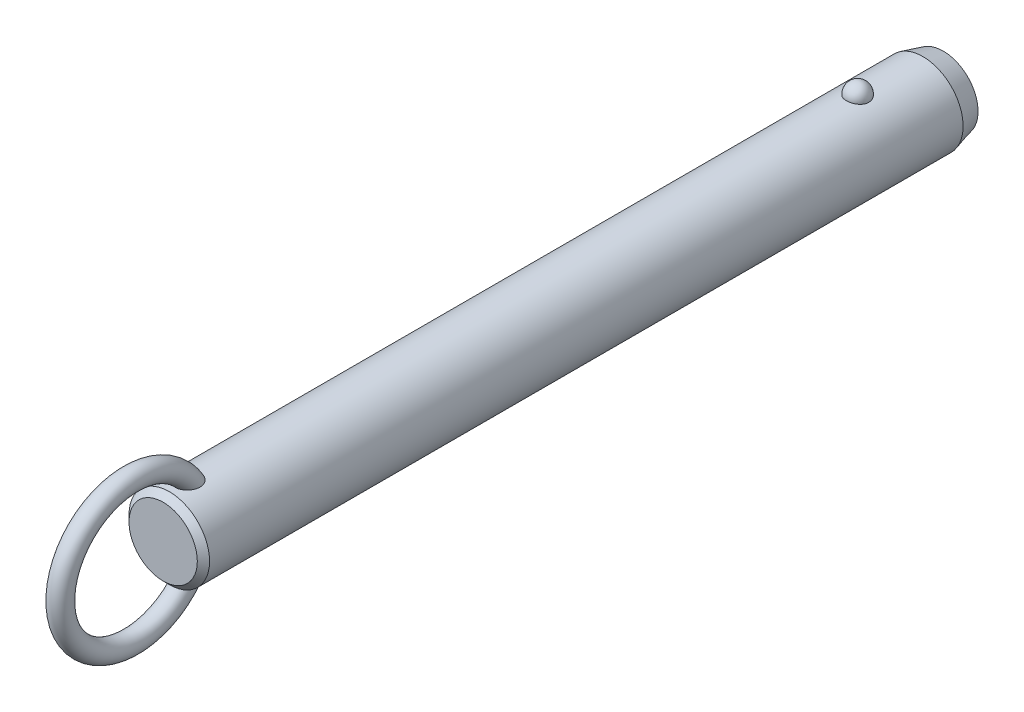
ISO-10303-21;
HEADER;
FILE_DESCRIPTION(('STEP AP214'),'2;1');
FILE_NAME('part.step','',(''),(''),'','','');
FILE_SCHEMA(('AUTOMOTIVE_DESIGN { 1 0 10303 214 1 1 1 1 }'));
ENDSEC;
DATA;
#1=APPLICATION_CONTEXT('core data for automotive mechanical design processes');
#2=APPLICATION_PROTOCOL_DEFINITION('international standard','automotive_design',2000,#1);
#3=PRODUCT_CONTEXT('',#1,'mechanical');
#4=PRODUCT('Part','Part','',(#3));
#5=PRODUCT_RELATED_PRODUCT_CATEGORY('part','',(#4));
#6=PRODUCT_DEFINITION_FORMATION('','',#4);
#7=PRODUCT_DEFINITION_CONTEXT('part definition',#1,'design');
#8=PRODUCT_DEFINITION('design','',#6,#7);
#9=PRODUCT_DEFINITION_SHAPE('','',#8);
#10=(LENGTH_UNIT() NAMED_UNIT(*) SI_UNIT(.MILLI.,.METRE.));
#11=(NAMED_UNIT(*) PLANE_ANGLE_UNIT() SI_UNIT($,.RADIAN.));
#12=(NAMED_UNIT(*) SI_UNIT($,.STERADIAN.) SOLID_ANGLE_UNIT());
#13=UNCERTAINTY_MEASURE_WITH_UNIT(LENGTH_MEASURE(1.E-05),#10,'distance_accuracy_value','');
#14=(GEOMETRIC_REPRESENTATION_CONTEXT(3) GLOBAL_UNCERTAINTY_ASSIGNED_CONTEXT((#13)) GLOBAL_UNIT_ASSIGNED_CONTEXT((#10,
#11,#12)) REPRESENTATION_CONTEXT('',''));
#15=CARTESIAN_POINT('',(0.,0.,0.));
#16=DIRECTION('',(0.,0.,1.));
#17=DIRECTION('',(1.,0.,0.));
#18=AXIS2_PLACEMENT_3D('',#15,#16,#17);
#19=CARTESIAN_POINT('',(0.,0.,124.5));
#20=DIRECTION('',(0.,0.,-1.));
#21=DIRECTION('',(-1.,0.,0.));
#22=AXIS2_PLACEMENT_3D('',#19,#20,#21);
#23=CYLINDRICAL_SURFACE('',#22,7.9);
#24=CARTESIAN_POINT('',(2.1785689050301,7.59367088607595,-2.19999999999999));
#25=CARTESIAN_POINT('',(2.17856679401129,7.59367269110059,-2.07701843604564));
#26=CARTESIAN_POINT('',(2.16853481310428,7.59657145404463,-1.95401006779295));
#27=CARTESIAN_POINT('',(2.12864689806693,7.607843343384,-1.71147811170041));
#28=CARTESIAN_POINT('',(2.09878338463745,7.61621856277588,-1.59195587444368));
#29=CARTESIAN_POINT('',(2.0199931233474,7.63749180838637,-1.3598563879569));
#30=CARTESIAN_POINT('',(1.97107475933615,7.6503878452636,-1.24727610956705));
#31=CARTESIAN_POINT('',(1.85539377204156,7.67926115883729,-1.03213234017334));
#32=CARTESIAN_POINT('',(1.78863158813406,7.69523835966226,-0.929568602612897));
#33=CARTESIAN_POINT('',(1.63856494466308,7.7285848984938,-0.736786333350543));
#34=CARTESIAN_POINT('',(1.55518140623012,7.7459606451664,-0.646630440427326));
#35=CARTESIAN_POINT('',(1.37422937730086,7.78009978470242,-0.481747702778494));
#36=CARTESIAN_POINT('',(1.27666086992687,7.79686317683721,-0.407020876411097));
#37=CARTESIAN_POINT('',(1.07024728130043,7.82786153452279,-0.275278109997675));
#38=CARTESIAN_POINT('',(0.961434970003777,7.84210353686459,-0.218212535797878));
#39=CARTESIAN_POINT('',(0.735351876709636,7.86652194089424,-0.123146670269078));
#40=CARTESIAN_POINT('',(0.618082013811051,7.87669878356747,-0.085144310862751));
#41=CARTESIAN_POINT('',(0.380637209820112,7.89170521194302,-0.0298158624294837));
#42=CARTESIAN_POINT('',(0.260550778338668,7.89662650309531,-0.0121347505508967));
#43=CARTESIAN_POINT('',(0.0190117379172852,7.90090003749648,0.00324379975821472));
#44=CARTESIAN_POINT('',(-0.102440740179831,7.90025280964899,0.00094313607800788));
#45=CARTESIAN_POINT('',(-0.341452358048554,7.89351056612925,-0.0233955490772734));
#46=CARTESIAN_POINT('',(-0.459042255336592,7.88749257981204,-0.0451545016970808));
#47=CARTESIAN_POINT('',(-0.688796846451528,7.87075812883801,-0.107408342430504));
#48=CARTESIAN_POINT('',(-0.800961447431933,7.86004158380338,-0.147903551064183));
#49=CARTESIAN_POINT('',(-1.01743634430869,7.83497131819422,-0.246799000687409));
#50=CARTESIAN_POINT('',(-1.12169791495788,7.82059709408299,-0.305300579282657));
#51=CARTESIAN_POINT('',(-1.31891765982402,7.78976470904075,-0.438549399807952));
#52=CARTESIAN_POINT('',(-1.41187469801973,7.77330633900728,-0.513298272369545));
#53=CARTESIAN_POINT('',(-1.58577142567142,7.73972434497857,-0.678622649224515));
#54=CARTESIAN_POINT('',(-1.66645140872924,7.72259402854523,-0.769470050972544));
#55=CARTESIAN_POINT('',(-1.81161503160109,7.68983776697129,-0.963538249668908));
#56=CARTESIAN_POINT('',(-1.87609753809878,7.6742119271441,-1.06675991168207));
#57=CARTESIAN_POINT('',(-1.98790138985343,7.6460202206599,-1.28401170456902));
#58=CARTESIAN_POINT('',(-2.03501994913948,7.63349104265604,-1.39815107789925));
#59=CARTESIAN_POINT('',(-2.10986724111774,7.6131449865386,-1.63301784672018));
#60=CARTESIAN_POINT('',(-2.1375965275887,7.60532797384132,-1.75374505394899));
#61=CARTESIAN_POINT('',(-2.17289256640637,7.5953195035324,-1.99782562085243));
#62=CARTESIAN_POINT('',(-2.18054294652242,7.59310471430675,-2.12116592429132));
#63=CARTESIAN_POINT('',(-2.17572919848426,7.59448538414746,-2.36741799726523));
#64=CARTESIAN_POINT('',(-2.1632656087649,7.59808068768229,-2.49032977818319));
#65=CARTESIAN_POINT('',(-2.11865035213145,7.61064035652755,-2.73161015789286));
#66=CARTESIAN_POINT('',(-2.08659579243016,7.61957823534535,-2.84999812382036));
#67=CARTESIAN_POINT('',(-2.00367799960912,7.64179982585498,-3.07955956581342));
#68=CARTESIAN_POINT('',(-1.9528140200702,7.65508371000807,-3.19073275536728));
#69=CARTESIAN_POINT('',(-1.83321113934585,7.68460381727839,-3.40337899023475));
#70=CARTESIAN_POINT('',(-1.76437735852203,7.70085556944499,-3.50479651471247));
#71=CARTESIAN_POINT('',(-1.61069526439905,7.73445734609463,-3.69446912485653));
#72=CARTESIAN_POINT('',(-1.52584634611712,7.75180741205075,-3.78272371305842));
#73=CARTESIAN_POINT('',(-1.34198059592,7.78574608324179,-3.94393987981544));
#74=CARTESIAN_POINT('',(-1.24291308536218,7.80233167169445,-4.01684434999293));
#75=CARTESIAN_POINT('',(-1.03352039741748,7.83281625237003,-4.14489386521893));
#76=CARTESIAN_POINT('',(-0.92319600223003,7.84671543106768,-4.20004014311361));
#77=CARTESIAN_POINT('',(-0.695822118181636,7.87011575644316,-4.29042017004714));
#78=CARTESIAN_POINT('',(-0.578872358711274,7.87966903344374,-4.32589112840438));
#79=CARTESIAN_POINT('',(-0.340410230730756,7.8935652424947,-4.37692226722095));
#80=CARTESIAN_POINT('',(-0.218898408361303,7.89790879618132,-4.39248482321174));
#81=CARTESIAN_POINT('',(0.0228107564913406,7.90087453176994,-4.40314405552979));
#82=CARTESIAN_POINT('',(0.142990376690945,7.89960185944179,-4.39861683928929));
#83=CARTESIAN_POINT('',(0.380829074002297,7.89171262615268,-4.37008293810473));
#84=CARTESIAN_POINT('',(0.498488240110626,7.8850962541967,-4.34607694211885));
#85=CARTESIAN_POINT('',(0.727535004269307,7.86726442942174,-4.27939317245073));
#86=CARTESIAN_POINT('',(0.838944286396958,7.85606616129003,-4.236785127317));
#87=CARTESIAN_POINT('',(1.05295421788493,7.83025654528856,-4.13408348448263));
#88=CARTESIAN_POINT('',(1.15555431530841,7.81564498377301,-4.07398879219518));
#89=CARTESIAN_POINT('',(1.35076763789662,7.7843022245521,-3.93687432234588));
#90=CARTESIAN_POINT('',(1.4432046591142,7.76754209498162,-3.85961036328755));
#91=CARTESIAN_POINT('',(1.6139111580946,7.73387857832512,-3.69076949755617));
#92=CARTESIAN_POINT('',(1.6921781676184,7.71697516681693,-3.59919010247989));
#93=CARTESIAN_POINT('',(1.83380875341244,7.6845643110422,-3.40247278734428));
#94=CARTESIAN_POINT('',(1.89689280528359,7.66908588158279,-3.29712873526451));
#95=CARTESIAN_POINT('',(2.0047823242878,7.64159441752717,-3.07707931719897));
#96=CARTESIAN_POINT('',(2.0495945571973,7.62958010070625,-2.96237743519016));
#97=CARTESIAN_POINT('',(2.11580183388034,7.61146617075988,-2.74040519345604));
#98=CARTESIAN_POINT('',(2.13929812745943,7.60484503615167,-2.63379846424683));
#99=CARTESIAN_POINT('',(2.17068242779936,7.59594664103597,-2.41813481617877));
#100=CARTESIAN_POINT('',(2.17857077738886,7.59366928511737,-2.30907795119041));
#101=CARTESIAN_POINT('',(2.1785689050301,7.59367088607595,-2.19999999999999));
#102=B_SPLINE_CURVE_WITH_KNOTS('',3,(#24,#25,#26,#27,#28,#29,#30,#31,#32,#33,#34,#35,#36,#37,
#38,#39,#40,#41,#42,#43,#44,#45,#46,#47,#48,#49,#50,#51,#52,#53,#54,#55,#56,#57,#58,#59,#60,#61,
#62,#63,#64,#65,#66,#67,#68,#69,#70,#71,#72,#73,#74,#75,#76,#77,#78,#79,#80,#81,#82,#83,#84,#85,
#86,#87,#88,#89,#90,#91,#92,#93,#94,#95,#96,#97,#98,#99,#100,#101),.UNSPECIFIED.,.T.,.F.,(4,2,2,
2,2,2,2,2,2,2,2,2,2,2,2,2,2,2,2,2,2,2,2,2,2,2,2,2,2,2,2,2,2,2,2,2,2,2,4),(0.,0.368552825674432,
0.737246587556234,1.10577831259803,1.4743009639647,1.8446206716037,2.21494081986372,
2.5842105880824,2.95344028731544,3.31611630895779,3.67875788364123,4.03628044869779,
4.39380913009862,4.75338791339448,5.11300280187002,5.47939989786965,5.8458226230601,
6.21639834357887,6.58696347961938,6.95598276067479,7.32499216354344,7.69218715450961,
8.0593967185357,8.42858578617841,8.79778880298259,9.16834203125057,9.5388695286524,
9.90482699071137,10.2707407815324,10.6298333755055,10.9889132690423,11.3466585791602,
11.7044262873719,12.0676511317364,12.4309391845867,12.8004764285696,13.1698767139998,
13.4967701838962,13.8236564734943),.UNSPECIFIED.);
#103=CARTESIAN_POINT('',(2.1785689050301,7.59367088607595,-2.19999999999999));
#104=VERTEX_POINT('',#103);
#105=EDGE_CURVE('E41',#104,#104,#102,.T.);
#106=ORIENTED_EDGE('',*,*,#105,.T.);
#107=EDGE_LOOP('',(#106));
#108=FACE_BOUND('',#107,.T.);
#109=CARTESIAN_POINT('',(0.,0.,132.82));
#110=DIRECTION('',(0.,0.,1.));
#111=DIRECTION('',(1.,0.,0.));
#112=AXIS2_PLACEMENT_3D('',#109,#110,#111);
#113=CIRCLE('',#112,7.9);
#114=CARTESIAN_POINT('',(7.9,0.,132.82));
#115=VERTEX_POINT('',#114);
#116=EDGE_CURVE('E10',#115,#115,#113,.F.);
#117=ORIENTED_EDGE('',*,*,#116,.T.);
#118=EDGE_LOOP('',(#117));
#119=FACE_BOUND('',#118,.T.);
#120=CARTESIAN_POINT('',(-0.630969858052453,-7.87476203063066,126.712432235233));
#121=CARTESIAN_POINT('',(-0.734180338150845,-7.86648998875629,126.747285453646));
#122=CARTESIAN_POINT('',(-0.83447695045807,-7.85639291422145,126.790816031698));
#123=CARTESIAN_POINT('',(-1.0262035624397,-7.83366343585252,126.894094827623));
#124=CARTESIAN_POINT('',(-1.1176141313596,-7.82102565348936,126.953877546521));
#125=CARTESIAN_POINT('',(-1.28877277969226,-7.79464922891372,127.087839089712));
#126=CARTESIAN_POINT('',(-1.36854014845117,-7.78091246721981,127.161993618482));
#127=CARTESIAN_POINT('',(-1.51461521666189,-7.75380398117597,127.322494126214));
#128=CARTESIAN_POINT('',(-1.58092966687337,-7.74043207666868,127.408833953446));
#129=CARTESIAN_POINT('',(-1.70019064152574,-7.7151252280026,127.592978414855));
#130=CARTESIAN_POINT('',(-1.75284037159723,-7.70322473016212,127.690979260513));
#131=CARTESIAN_POINT('',(-1.84263464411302,-7.68224112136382,127.894102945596));
#132=CARTESIAN_POINT('',(-1.87977299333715,-7.6731591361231,127.999228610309));
#133=CARTESIAN_POINT('',(-1.94152728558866,-7.65777930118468,128.223284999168));
#134=CARTESIAN_POINT('',(-1.96475471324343,-7.65179654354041,128.342616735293));
#135=CARTESIAN_POINT('',(-1.99449499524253,-7.64409642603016,128.58342986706));
#136=CARTESIAN_POINT('',(-2.0010005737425,-7.64238092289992,128.704912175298));
#137=CARTESIAN_POINT('',(-1.99856014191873,-7.64302120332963,128.968340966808));
#138=CARTESIAN_POINT('',(-1.98680021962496,-7.64611845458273,129.11025654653));
#139=CARTESIAN_POINT('',(-1.94457772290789,-7.65696186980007,129.391118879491));
#140=CARTESIAN_POINT('',(-1.91409393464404,-7.66471330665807,129.530062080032));
#141=CARTESIAN_POINT('',(-1.82768670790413,-7.68582947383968,129.831939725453));
#142=CARTESIAN_POINT('',(-1.76772963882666,-7.70003779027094,129.993686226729));
#143=CARTESIAN_POINT('',(-1.65998501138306,-7.72371550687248,130.227695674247));
#144=CARTESIAN_POINT('',(-1.62107967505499,-7.73200670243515,130.304297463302));
#145=CARTESIAN_POINT('',(-1.53727726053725,-7.7491037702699,130.454079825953));
#146=CARTESIAN_POINT('',(-1.49238215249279,-7.75790947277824,130.527261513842));
#147=CARTESIAN_POINT('',(-1.37397050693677,-7.77993338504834,130.70288382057));
#148=CARTESIAN_POINT('',(-1.29690364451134,-7.79328473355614,130.802955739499));
#149=CARTESIAN_POINT('',(-1.12885487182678,-7.81939266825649,130.990714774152));
#150=CARTESIAN_POINT('',(-1.03789926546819,-7.83215032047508,131.078424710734));
#151=CARTESIAN_POINT('',(-0.869532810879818,-7.85231710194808,131.213414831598));
#152=CARTESIAN_POINT('',(-0.795716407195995,-7.86021093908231,131.265076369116));
#153=CARTESIAN_POINT('',(-0.640813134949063,-7.87434920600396,131.356381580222));
#154=CARTESIAN_POINT('',(-0.559737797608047,-7.88059619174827,131.39604389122));
#155=CARTESIAN_POINT('',(-0.406456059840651,-7.88984116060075,131.454300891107));
#156=CARTESIAN_POINT('',(-0.335227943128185,-7.89321892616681,131.475384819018));
#157=CARTESIAN_POINT('',(-0.190193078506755,-7.89804235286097,131.50541418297));
#158=CARTESIAN_POINT('',(-0.116388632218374,-7.89948969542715,131.514370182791));
#159=CARTESIAN_POINT('',(0.0318414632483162,-7.90028409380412,131.519291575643));
#160=CARTESIAN_POINT('',(0.106268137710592,-7.89962640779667,131.515227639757));
#161=CARTESIAN_POINT('',(0.253290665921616,-7.8962818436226,131.494461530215));
#162=CARTESIAN_POINT('',(0.325885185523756,-7.8935935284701,131.477750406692));
#163=CARTESIAN_POINT('',(0.481441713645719,-7.88577340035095,131.428738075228));
#164=CARTESIAN_POINT('',(0.563611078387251,-7.88026321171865,131.394005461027));
#165=CARTESIAN_POINT('',(0.721129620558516,-7.86741729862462,131.311796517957));
#166=CARTESIAN_POINT('',(0.79646633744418,-7.86007832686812,131.264297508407));
#167=CARTESIAN_POINT('',(0.971456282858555,-7.84073285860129,131.136513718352));
#168=CARTESIAN_POINT('',(1.06719686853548,-7.82809461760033,131.051004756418));
#169=CARTESIAN_POINT('',(1.24418921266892,-7.80192439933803,130.866232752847));
#170=CARTESIAN_POINT('',(1.32540832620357,-7.78839049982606,130.766939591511));
#171=CARTESIAN_POINT('',(1.45199971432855,-7.76559693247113,130.589576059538));
#172=CARTESIAN_POINT('',(1.50085649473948,-7.75626094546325,130.513954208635));
#173=CARTESIAN_POINT('',(1.59197749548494,-7.73807279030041,130.358742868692));
#174=CARTESIAN_POINT('',(1.63423919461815,-7.72922080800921,130.279151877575));
#175=CARTESIAN_POINT('',(1.71222612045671,-7.71231959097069,130.116664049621));
#176=CARTESIAN_POINT('',(1.74794516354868,-7.70427111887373,130.033764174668));
#177=CARTESIAN_POINT('',(1.81270113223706,-7.68929240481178,129.865296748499));
#178=CARTESIAN_POINT('',(1.84173789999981,-7.68236218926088,129.779729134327));
#179=CARTESIAN_POINT('',(1.89322698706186,-7.6698375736,129.60528702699));
#180=CARTESIAN_POINT('',(1.91558744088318,-7.66426199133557,129.516383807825));
#181=CARTESIAN_POINT('',(1.95281367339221,-7.65485915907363,129.336969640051));
#182=CARTESIAN_POINT('',(1.96767946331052,-7.65103190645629,129.246458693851));
#183=CARTESIAN_POINT('',(2.0002145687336,-7.64262981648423,128.973732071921));
#184=CARTESIAN_POINT('',(2.00600691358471,-7.6410871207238,128.789709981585));
#185=CARTESIAN_POINT('',(1.98445334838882,-7.64669564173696,128.476501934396));
#186=CARTESIAN_POINT('',(1.96607186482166,-7.65149688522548,128.346618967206));
#187=CARTESIAN_POINT('',(1.90884967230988,-7.66597624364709,128.091632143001));
#188=CARTESIAN_POINT('',(1.87002101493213,-7.67565148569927,127.966525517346));
#189=CARTESIAN_POINT('',(1.77063986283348,-7.69918471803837,127.72454013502));
#190=CARTESIAN_POINT('',(1.70993724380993,-7.71307150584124,127.607725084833));
#191=CARTESIAN_POINT('',(1.56733070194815,-7.74330306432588,127.388144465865));
#192=CARTESIAN_POINT('',(1.48543692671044,-7.75964665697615,127.285372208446));
#193=CARTESIAN_POINT('',(1.31346177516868,-7.79047523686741,127.109380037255));
#194=CARTESIAN_POINT('',(1.22547278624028,-7.80495298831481,127.034106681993));
#195=CARTESIAN_POINT('',(1.03724352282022,-7.83218597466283,126.900486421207));
#196=CARTESIAN_POINT('',(0.93700840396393,-7.84494192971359,126.842132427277));
#197=CARTESIAN_POINT('',(0.733599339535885,-7.86649045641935,126.747027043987));
#198=CARTESIAN_POINT('',(0.630941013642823,-7.87547134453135,126.709210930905));
#199=CARTESIAN_POINT('',(0.420465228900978,-7.88950708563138,126.651116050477));
#200=CARTESIAN_POINT('',(0.312645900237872,-7.89456050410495,126.63084369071));
#201=CARTESIAN_POINT('',(0.096086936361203,-7.9001518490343,126.608455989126));
#202=CARTESIAN_POINT('',(-0.0126341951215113,-7.90073226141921,126.606169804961));
#203=CARTESIAN_POINT('',(-0.228766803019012,-7.89742350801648,126.619367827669));
#204=CARTESIAN_POINT('',(-0.336180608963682,-7.89354403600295,126.634813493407));
#205=CARTESIAN_POINT('',(-0.473410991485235,-7.88586871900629,126.666217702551));
#206=CARTESIAN_POINT('',(-0.50525779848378,-7.88388984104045,126.674354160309));
#207=CARTESIAN_POINT('',(-0.56848128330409,-7.87958326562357,126.692208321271));
#208=CARTESIAN_POINT('',(-0.59985795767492,-7.87725556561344,126.701926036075));
#209=CARTESIAN_POINT('',(-0.630969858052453,-7.87476203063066,126.712432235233));
#210=B_SPLINE_CURVE_WITH_KNOTS('',3,(#120,#121,#122,#123,#124,#125,#126,#127,#128,#129,#130,
#131,#132,#133,#134,#135,#136,#137,#138,#139,#140,#141,#142,#143,#144,#145,#146,#147,#148,#149,
#150,#151,#152,#153,#154,#155,#156,#157,#158,#159,#160,#161,#162,#163,#164,#165,#166,#167,#168,
#169,#170,#171,#172,#173,#174,#175,#176,#177,#178,#179,#180,#181,#182,#183,#184,#185,#186,#187,
#188,#189,#190,#191,#192,#193,#194,#195,#196,#197,#198,#199,#200,#201,#202,#203,#204,#205,#206,
#207,#208,#209),.UNSPECIFIED.,.T.,.F.,(4,2,2,2,2,2,2,2,2,2,2,2,2,2,2,2,2,2,2,2,2,2,2,2,2,2,2,2,
2,2,2,2,2,2,2,2,2,2,2,2,2,2,2,2,4),(0.,0.327622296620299,0.655945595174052,0.983718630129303,
1.3113267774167,1.64554655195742,1.97989964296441,2.34365728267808,2.70757317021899,
3.13333684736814,3.5595838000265,4.07655306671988,4.33527897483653,4.59391999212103,
4.97382437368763,5.353017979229,5.62348245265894,5.89352465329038,6.11565959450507,
6.33760092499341,6.56004255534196,6.78264174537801,7.04930844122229,7.31645206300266,
7.70130871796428,8.08701995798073,8.35824509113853,8.6295736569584,8.9011573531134,
9.1727474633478,9.44791855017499,9.72308922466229,10.2715298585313,10.6638393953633,
11.0559179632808,11.4507403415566,11.8453740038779,12.1936425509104,12.5417649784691,
12.8695063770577,13.1973674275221,13.5221104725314,13.8461490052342,13.9449071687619,
14.0436660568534),.UNSPECIFIED.);
#211=CARTESIAN_POINT('',(-0.630969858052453,-7.87476203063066,126.712432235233));
#212=VERTEX_POINT('',#211);
#213=EDGE_CURVE('E60',#212,#212,#210,.T.);
#214=ORIENTED_EDGE('',*,*,#213,.T.);
#215=EDGE_LOOP('',(#214));
#216=FACE_BOUND('',#215,.T.);
#217=CARTESIAN_POINT('',(-0.630969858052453,7.87476203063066,126.712432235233));
#218=CARTESIAN_POINT('',(-0.528918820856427,7.88293636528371,126.677979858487));
#219=CARTESIAN_POINT('',(-0.423745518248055,7.88934810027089,126.651915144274));
#220=CARTESIAN_POINT('',(-0.21023608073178,7.8979273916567,126.617282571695));
#221=CARTESIAN_POINT('',(-0.10189380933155,7.90008607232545,126.608751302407));
#222=CARTESIAN_POINT('',(0.114660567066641,7.89990877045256,126.609457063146));
#223=CARTESIAN_POINT('',(0.222872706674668,7.89757640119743,126.61867980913));
#224=CARTESIAN_POINT('',(0.436107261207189,7.88867538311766,126.654652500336));
#225=CARTESIAN_POINT('',(0.541131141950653,7.8821087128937,126.68139425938));
#226=CARTESIAN_POINT('',(0.745085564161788,7.86545130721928,126.751756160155));
#227=CARTESIAN_POINT('',(0.844015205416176,7.85536005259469,126.795378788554));
#228=CARTESIAN_POINT('',(1.03299167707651,7.83275153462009,126.898379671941));
#229=CARTESIAN_POINT('',(1.12303841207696,7.8202342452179,126.957758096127));
#230=CARTESIAN_POINT('',(1.29214734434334,7.79408219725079,127.090864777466));
#231=CARTESIAN_POINT('',(1.37116907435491,7.78044359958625,127.164643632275));
#232=CARTESIAN_POINT('',(1.51597677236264,7.75353170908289,127.324235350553));
#233=CARTESIAN_POINT('',(1.58176261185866,7.74025841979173,127.410048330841));
#234=CARTESIAN_POINT('',(1.70057386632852,7.71504069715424,127.593644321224));
#235=CARTESIAN_POINT('',(1.75320073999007,7.7031425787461,127.691690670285));
#236=CARTESIAN_POINT('',(1.8429376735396,7.68216822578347,127.894893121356));
#237=CARTESIAN_POINT('',(1.88004278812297,7.67309289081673,128.000051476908));
#238=CARTESIAN_POINT('',(1.9417232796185,7.6577294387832,128.224167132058));
#239=CARTESIAN_POINT('',(1.96491037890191,7.65175648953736,128.343524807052));
#240=CARTESIAN_POINT('',(1.9945689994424,7.64407702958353,128.584384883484));
#241=CARTESIAN_POINT('',(2.00103304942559,7.64237242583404,128.70588821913));
#242=CARTESIAN_POINT('',(1.99850166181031,7.64303650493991,128.969368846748));
#243=CARTESIAN_POINT('',(1.98669038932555,7.64614714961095,129.111314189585));
#244=CARTESIAN_POINT('',(1.94436120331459,7.6570170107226,129.392228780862));
#245=CARTESIAN_POINT('',(1.91382203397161,7.66478150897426,129.531194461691));
#246=CARTESIAN_POINT('',(1.82728754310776,7.68592483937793,129.833111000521));
#247=CARTESIAN_POINT('',(1.76725778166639,7.7001468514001,129.994872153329));
#248=CARTESIAN_POINT('',(1.65939700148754,7.72384204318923,130.228891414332));
#249=CARTESIAN_POINT('',(1.62045187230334,7.73213852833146,130.305494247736));
#250=CARTESIAN_POINT('',(1.53656684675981,7.74924489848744,130.455273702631));
#251=CARTESIAN_POINT('',(1.49162892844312,7.75805461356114,130.528451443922));
#252=CARTESIAN_POINT('',(1.37317698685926,7.78007342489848,130.703952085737));
#253=CARTESIAN_POINT('',(1.29612360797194,7.79341423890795,130.803911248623));
#254=CARTESIAN_POINT('',(1.12812043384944,7.81949839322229,130.99145083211));
#255=CARTESIAN_POINT('',(1.03719688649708,7.83224280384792,131.079054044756));
#256=CARTESIAN_POINT('',(0.868871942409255,7.85239026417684,131.21389715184));
#257=CARTESIAN_POINT('',(0.795056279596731,7.86027769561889,131.265511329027));
#258=CARTESIAN_POINT('',(0.640160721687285,7.87440222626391,131.356720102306));
#259=CARTESIAN_POINT('',(0.559092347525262,7.88064188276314,131.396333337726));
#260=CARTESIAN_POINT('',(0.405820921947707,7.8898738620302,131.454505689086));
#261=CARTESIAN_POINT('',(0.334594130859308,7.89324577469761,131.475552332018));
#262=CARTESIAN_POINT('',(0.189568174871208,7.89805733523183,131.505507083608));
#263=CARTESIAN_POINT('',(0.115771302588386,7.89949866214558,131.514425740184));
#264=CARTESIAN_POINT('',(-0.0324359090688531,7.90028156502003,131.51927589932));
#265=CARTESIAN_POINT('',(-0.106847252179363,7.89961843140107,131.515178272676));
#266=CARTESIAN_POINT('',(-0.253834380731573,7.8962642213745,131.494351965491));
#267=CARTESIAN_POINT('',(-0.326408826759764,7.89357170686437,131.477614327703));
#268=CARTESIAN_POINT('',(-0.481962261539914,7.88574179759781,131.428539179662));
#269=CARTESIAN_POINT('',(-0.564145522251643,7.88022507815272,131.393763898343));
#270=CARTESIAN_POINT('',(-0.721685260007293,7.86736646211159,131.311468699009));
#271=CARTESIAN_POINT('',(-0.797029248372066,7.8600213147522,131.263926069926));
#272=CARTESIAN_POINT('',(-0.9720442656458,7.84066026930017,131.136026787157));
#273=CARTESIAN_POINT('',(-1.06779803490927,7.82801274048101,131.050443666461));
#274=CARTESIAN_POINT('',(-1.2448053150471,7.80182621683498,130.865522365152));
#275=CARTESIAN_POINT('',(-1.32602618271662,7.78828530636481,130.766154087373));
#276=CARTESIAN_POINT('',(-1.45259834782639,7.76548487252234,130.588680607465));
#277=CARTESIAN_POINT('',(-1.50143856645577,7.75614818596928,130.513025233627));
#278=CARTESIAN_POINT('',(-1.59252410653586,7.73796020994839,130.357748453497));
#279=CARTESIAN_POINT('',(-1.63476690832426,7.72910910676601,130.278125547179));
#280=CARTESIAN_POINT('',(-1.71271318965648,7.71221133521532,130.115575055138));
#281=CARTESIAN_POINT('',(-1.74841047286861,7.70416543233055,130.032644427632));
#282=CARTESIAN_POINT('',(-1.81311929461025,7.6891937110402,129.864116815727));
#283=CARTESIAN_POINT('',(-1.84213067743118,7.68226791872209,129.778519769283));
#284=CARTESIAN_POINT('',(-1.89356259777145,7.66975461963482,129.604025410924));
#285=CARTESIAN_POINT('',(-1.91589165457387,7.66418586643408,129.515099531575));
#286=CARTESIAN_POINT('',(-1.9530507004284,7.65479859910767,129.335642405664));
#287=CARTESIAN_POINT('',(-1.96788069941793,7.65098008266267,129.245111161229));
#288=CARTESIAN_POINT('',(-2.00030078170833,7.64260704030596,128.972327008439));
#289=CARTESIAN_POINT('',(-2.00600576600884,7.64108760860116,128.788271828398));
#290=CARTESIAN_POINT('',(-1.9842848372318,7.64673945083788,128.475080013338));
#291=CARTESIAN_POINT('',(-1.96583698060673,7.65155751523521,128.345240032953));
#292=CARTESIAN_POINT('',(-1.90848948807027,7.66606613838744,128.090361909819));
#293=CARTESIAN_POINT('',(-1.86960376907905,7.67575338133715,127.965320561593));
#294=CARTESIAN_POINT('',(-1.77013421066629,7.6993013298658,127.723500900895));
#295=CARTESIAN_POINT('',(-1.70940488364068,7.71318991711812,127.606784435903));
#296=CARTESIAN_POINT('',(-1.56672953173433,7.74342495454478,127.387340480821));
#297=CARTESIAN_POINT('',(-1.48478316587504,7.75977144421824,127.28461321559));
#298=CARTESIAN_POINT('',(-1.31266325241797,7.79061163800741,127.108643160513));
#299=CARTESIAN_POINT('',(-1.22456383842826,7.80509908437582,127.033358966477));
#300=CARTESIAN_POINT('',(-1.03622400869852,7.83231881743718,126.899865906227));
#301=CARTESIAN_POINT('',(-0.936015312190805,7.84505551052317,126.841613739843));
#302=CARTESIAN_POINT('',(-0.79882464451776,7.85957802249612,126.777540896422));
#303=CARTESIAN_POINT('',(-0.765787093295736,7.86286821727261,126.763224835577));
#304=CARTESIAN_POINT('',(-0.698939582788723,7.86909211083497,126.736436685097));
#305=CARTESIAN_POINT('',(-0.665129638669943,7.8720258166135,126.723964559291));
#306=CARTESIAN_POINT('',(-0.630969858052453,7.87476203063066,126.712432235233));
#307=B_SPLINE_CURVE_WITH_KNOTS('',3,(#217,#218,#219,#220,#221,#222,#223,#224,#225,#226,#227,
#228,#229,#230,#231,#232,#233,#234,#235,#236,#237,#238,#239,#240,#241,#242,#243,#244,#245,#246,
#247,#248,#249,#250,#251,#252,#253,#254,#255,#256,#257,#258,#259,#260,#261,#262,#263,#264,#265,
#266,#267,#268,#269,#270,#271,#272,#273,#274,#275,#276,#277,#278,#279,#280,#281,#282,#283,#284,
#285,#286,#287,#288,#289,#290,#291,#292,#293,#294,#295,#296,#297,#298,#299,#300,#301,#302,#303,
#304,#305,#306),.UNSPECIFIED.,.T.,.F.,(4,2,2,2,2,2,2,2,2,2,2,2,2,2,2,2,2,2,2,2,2,2,2,2,2,2,2,2,
2,2,2,2,2,2,2,2,2,2,2,2,2,2,2,2,4),(0.,0.323920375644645,0.648516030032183,0.972850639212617,
1.29703380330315,1.62126473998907,1.94549915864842,2.27089401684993,2.5962920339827,
2.93059633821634,3.26500707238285,3.6288164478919,3.99278833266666,4.4186542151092,
4.84500434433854,5.36209210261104,5.62087589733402,5.87957448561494,6.25918598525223,
6.63808782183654,6.90846748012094,7.17842501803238,7.40052350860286,7.6224287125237,
7.84483086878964,8.0673907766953,8.33414615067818,8.60137921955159,8.98641454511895,
9.37230415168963,9.64358673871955,9.91497268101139,10.1866142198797,10.4582620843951,
10.7334745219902,11.008686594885,11.5572126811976,11.9494246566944,12.3413699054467,
12.7359755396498,13.1305875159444,13.4791770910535,13.82687259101,13.9353013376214,
14.0437279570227),.UNSPECIFIED.);
#308=CARTESIAN_POINT('',(-0.630969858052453,7.87476203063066,126.712432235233));
#309=VERTEX_POINT('',#308);
#310=EDGE_CURVE('E67',#309,#309,#307,.T.);
#311=ORIENTED_EDGE('',*,*,#310,.T.);
#312=EDGE_LOOP('',(#311));
#313=FACE_BOUND('',#312,.T.);
#314=CARTESIAN_POINT('',(0.,0.,-15.));
#315=DIRECTION('',(0.,0.,-1.));
#316=DIRECTION('',(-1.,0.,0.));
#317=AXIS2_PLACEMENT_3D('',#314,#315,#316);
#318=CIRCLE('',#317,7.9);
#319=CARTESIAN_POINT('',(-7.9,0.,-15.));
#320=VERTEX_POINT('',#319);
#321=EDGE_CURVE('E57',#320,#320,#318,.F.);
#322=ORIENTED_EDGE('',*,*,#321,.T.);
#323=EDGE_LOOP('',(#322));
#324=FACE_BOUND('',#323,.T.);
#325=ADVANCED_FACE('F37',(#108,#119,#216,#313,#324),#23,.T.);
#326=CARTESIAN_POINT('',(0.,0.,-19.));
#327=DIRECTION('',(0.,0.,-1.));
#328=DIRECTION('',(-1.,0.,0.));
#329=AXIS2_PLACEMENT_3D('',#326,#327,#328);
#330=PLANE('',#329);
#331=CARTESIAN_POINT('',(0.,0.,-19.));
#332=DIRECTION('',(0.,0.,-1.));
#333=DIRECTION('',(-1.,0.,0.));
#334=AXIS2_PLACEMENT_3D('',#331,#332,#333);
#335=CIRCLE('',#334,6.82820323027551);
#336=CARTESIAN_POINT('',(-6.82820323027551,0.,-19.));
#337=VERTEX_POINT('',#336);
#338=EDGE_CURVE('E66',#337,#337,#335,.T.);
#339=ORIENTED_EDGE('',*,*,#338,.T.);
#340=EDGE_LOOP('',(#339));
#341=FACE_BOUND('',#340,.T.);
#342=ADVANCED_FACE('F85',(#341),#330,.T.);
#343=CARTESIAN_POINT('',(0.,0.,-19.));
#344=DIRECTION('',(0.,0.,1.));
#345=DIRECTION('',(1.,0.,0.));
#346=AXIS2_PLACEMENT_3D('',#343,#344,#345);
#347=CONICAL_SURFACE('',#346,6.82820323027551,0.261799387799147);
#348=ORIENTED_EDGE('',*,*,#321,.F.);
#349=EDGE_LOOP('',(#348));
#350=FACE_BOUND('',#349,.T.);
#351=ORIENTED_EDGE('',*,*,#338,.F.);
#352=EDGE_LOOP('',(#351));
#353=FACE_BOUND('',#352,.T.);
#354=ADVANCED_FACE('F83',(#350,#353),#347,.T.);
#355=CARTESIAN_POINT('',(0.,0.,134.02));
#356=DIRECTION('',(0.,0.,1.));
#357=DIRECTION('',(1.,0.,0.));
#358=AXIS2_PLACEMENT_3D('',#355,#356,#357);
#359=PLANE('',#358);
#360=CARTESIAN_POINT('',(0.,0.,134.02));
#361=DIRECTION('',(0.,0.,1.));
#362=DIRECTION('',(1.,0.,0.));
#363=AXIS2_PLACEMENT_3D('',#360,#361,#362);
#364=CIRCLE('',#363,6.69999999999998);
#365=CARTESIAN_POINT('',(6.69999999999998,0.,134.02));
#366=VERTEX_POINT('',#365);
#367=EDGE_CURVE('E50',#366,#366,#364,.T.);
#368=ORIENTED_EDGE('',*,*,#367,.T.);
#369=EDGE_LOOP('',(#368));
#370=FACE_BOUND('',#369,.T.);
#371=ADVANCED_FACE('F77',(#370),#359,.T.);
#372=CARTESIAN_POINT('',(0.,0.,140.35));
#373=DIRECTION('',(1.,0.,0.));
#374=DIRECTION('',(0.,0.,-1.));
#375=AXIS2_PLACEMENT_3D('',#372,#373,#374);
#376=TOROIDAL_SURFACE('',#375,13.85,2.);
#377=ORIENTED_EDGE('',*,*,#310,.F.);
#378=EDGE_LOOP('',(#377));
#379=FACE_BOUND('',#378,.T.);
#380=ORIENTED_EDGE('',*,*,#213,.F.);
#381=EDGE_LOOP('',(#380));
#382=FACE_BOUND('',#381,.T.);
#383=ADVANCED_FACE('F73',(#379,#382),#376,.T.);
#384=CARTESIAN_POINT('',(0.,0.,134.02));
#385=DIRECTION('',(0.,0.,-1.));
#386=DIRECTION('',(-1.,0.,0.));
#387=AXIS2_PLACEMENT_3D('',#384,#385,#386);
#388=CONICAL_SURFACE('',#387,6.69999999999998,0.785398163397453);
#389=ORIENTED_EDGE('',*,*,#116,.F.);
#390=EDGE_LOOP('',(#389));
#391=FACE_BOUND('',#390,.T.);
#392=ORIENTED_EDGE('',*,*,#367,.F.);
#393=EDGE_LOOP('',(#392));
#394=FACE_BOUND('',#393,.T.);
#395=ADVANCED_FACE('F39',(#391,#394),#388,.T.);
#396=CARTESIAN_POINT('',(0.,7.9,-2.19999999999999));
#397=DIRECTION('',(0.,1.,0.));
#398=DIRECTION('',(0.,0.,-1.));
#399=AXIS2_PLACEMENT_3D('',#396,#397,#398);
#400=SPHERICAL_SURFACE('',#399,2.2);
#401=ORIENTED_EDGE('',*,*,#105,.F.);
#402=EDGE_LOOP('',(#401));
#403=FACE_BOUND('',#402,.T.);
#404=ADVANCED_FACE('F79',(#403),#400,.T.);
#405=CLOSED_SHELL('',(#325,#342,#354,#371,#383,#395,#404));
#406=MANIFOLD_SOLID_BREP('B2',#405);
#407=ADVANCED_BREP_SHAPE_REPRESENTATION('',(#18,#406),#14);
#408=SHAPE_DEFINITION_REPRESENTATION(#9,#407);
ENDSEC;
END-ISO-10303-21;
